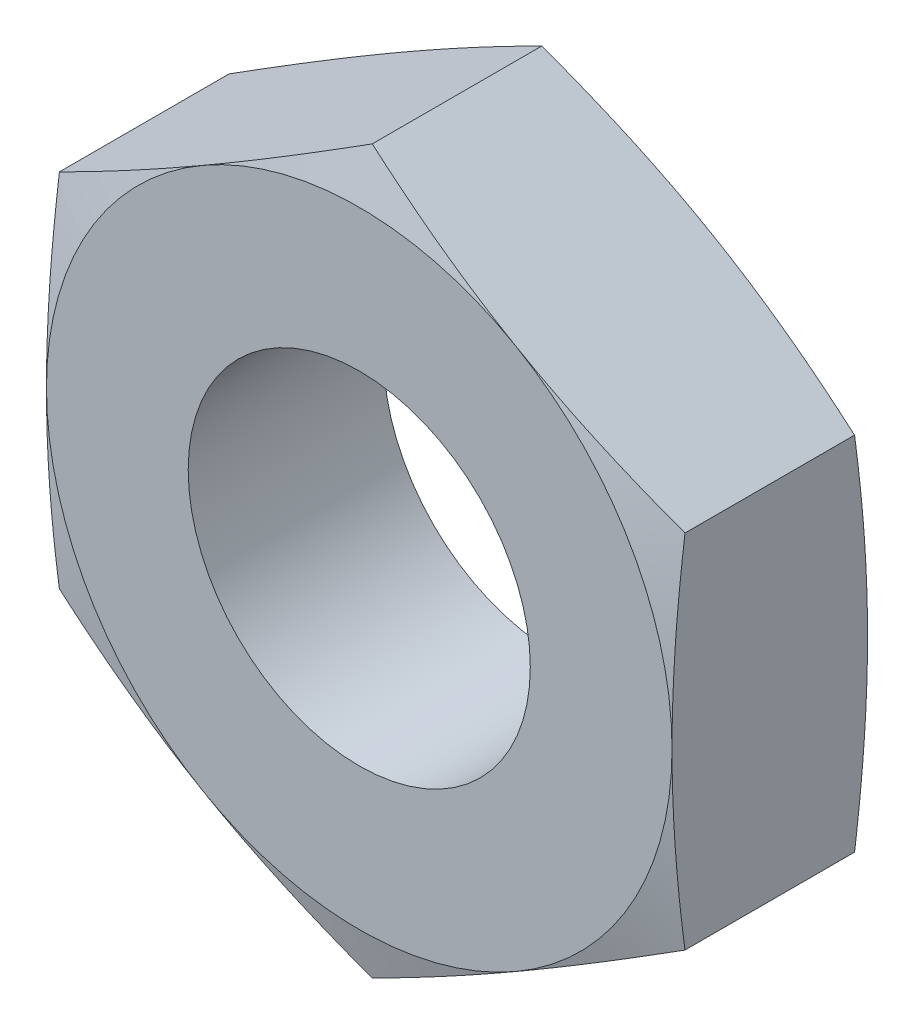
ISO-10303-21;
HEADER;
FILE_DESCRIPTION(('STEP AP214'),'2;1');
FILE_NAME('part.step','',(''),(''),'','','');
FILE_SCHEMA(('AUTOMOTIVE_DESIGN { 1 0 10303 214 1 1 1 1 }'));
ENDSEC;
DATA;
#1=APPLICATION_CONTEXT('core data for automotive mechanical design processes');
#2=APPLICATION_PROTOCOL_DEFINITION('international standard','automotive_design',2000,#1);
#3=PRODUCT_CONTEXT('',#1,'mechanical');
#4=PRODUCT('Part','Part','',(#3));
#5=PRODUCT_RELATED_PRODUCT_CATEGORY('part','',(#4));
#6=PRODUCT_DEFINITION_FORMATION('','',#4);
#7=PRODUCT_DEFINITION_CONTEXT('part definition',#1,'design');
#8=PRODUCT_DEFINITION('design','',#6,#7);
#9=PRODUCT_DEFINITION_SHAPE('','',#8);
#10=(LENGTH_UNIT() NAMED_UNIT(*) SI_UNIT(.MILLI.,.METRE.));
#11=(NAMED_UNIT(*) PLANE_ANGLE_UNIT() SI_UNIT($,.RADIAN.));
#12=(NAMED_UNIT(*) SI_UNIT($,.STERADIAN.) SOLID_ANGLE_UNIT());
#13=UNCERTAINTY_MEASURE_WITH_UNIT(LENGTH_MEASURE(1.E-05),#10,'distance_accuracy_value','');
#14=(GEOMETRIC_REPRESENTATION_CONTEXT(3) GLOBAL_UNCERTAINTY_ASSIGNED_CONTEXT((#13)) GLOBAL_UNIT_ASSIGNED_CONTEXT((#10,
#11,#12)) REPRESENTATION_CONTEXT('',''));
#15=CARTESIAN_POINT('',(0.,0.,0.));
#16=DIRECTION('',(0.,0.,1.));
#17=DIRECTION('',(1.,0.,0.));
#18=AXIS2_PLACEMENT_3D('',#15,#16,#17);
#19=CARTESIAN_POINT('',(0.,9.23760430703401,5.));
#20=DIRECTION('',(0.5,-0.866025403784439,0.));
#21=DIRECTION('',(0.866025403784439,0.5,0.));
#22=AXIS2_PLACEMENT_3D('',#19,#20,#21);
#23=PLANE('',#22);
#24=CARTESIAN_POINT('',(-8.0002,4.61868668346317,0.331646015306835));
#25=CARTESIAN_POINT('',(-7.66796351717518,4.81050350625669,0.280227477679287));
#26=CARTESIAN_POINT('',(-7.33512465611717,5.0026681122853,0.233547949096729));
#27=CARTESIAN_POINT('',(-6.66827150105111,5.38767596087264,0.151536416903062));
#28=CARTESIAN_POINT('',(-6.33425678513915,5.58051944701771,0.116209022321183));
#29=CARTESIAN_POINT('',(-5.66707702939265,5.96571585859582,0.0589641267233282));
#30=CARTESIAN_POINT('',(-5.33391650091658,6.15806617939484,0.036978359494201));
#31=CARTESIAN_POINT('',(-4.66717058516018,6.54301211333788,0.00749769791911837));
#32=CARTESIAN_POINT('',(-4.33358529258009,6.7356076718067,0.));
#33=CARTESIAN_POINT('',(-3.66641470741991,7.12079878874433,0.));
#34=CARTESIAN_POINT('',(-3.33282941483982,7.31339434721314,0.00749769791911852));
#35=CARTESIAN_POINT('',(-2.66608349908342,7.69834028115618,0.0369783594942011));
#36=CARTESIAN_POINT('',(-2.33292297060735,7.8906906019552,0.0589641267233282));
#37=CARTESIAN_POINT('',(-1.66574321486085,8.27588701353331,0.116209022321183));
#38=CARTESIAN_POINT('',(-1.33172849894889,8.46873049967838,0.151536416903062));
#39=CARTESIAN_POINT('',(-0.664875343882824,8.85373834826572,0.23354794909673));
#40=CARTESIAN_POINT('',(-0.332036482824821,9.04590295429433,0.280227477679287));
#41=CARTESIAN_POINT('',(0.000200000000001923,9.23771977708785,0.331646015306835));
#42=B_SPLINE_CURVE_WITH_KNOTS('',3,(#24,#25,#26,#27,#28,#29,#30,#31,#32,#33,#34,#35,#36,#37,#38,
#39,#40,#41),.UNSPECIFIED.,.F.,.F.,(4,2,2,2,2,2,2,2,4),(0.,1.1612532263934,2.322977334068,
3.47870589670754,4.63421079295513,5.78971568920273,6.94544425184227,8.10716835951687,
9.26842158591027),.UNSPECIFIED.);
#43=CARTESIAN_POINT('',(-8.,4.61880215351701,0.331615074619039));
#44=VERTEX_POINT('',#43);
#45=CARTESIAN_POINT('',(-4.,6.92820323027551,0.));
#46=VERTEX_POINT('',#45);
#47=EDGE_CURVE('E126',#44,#46,#42,.T.);
#48=ORIENTED_EDGE('',*,*,#47,.F.);
#49=DIRECTION('',(0.,0.,-1.));
#50=VECTOR('',#49,1.);
#51=CARTESIAN_POINT('',(-8.,4.61880215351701,5.));
#52=LINE('',#51,#50);
#53=CARTESIAN_POINT('',(-8.,4.61880215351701,4.66838492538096));
#54=VERTEX_POINT('',#53);
#55=EDGE_CURVE('E213',#54,#44,#52,.T.);
#56=ORIENTED_EDGE('',*,*,#55,.F.);
#57=CARTESIAN_POINT('',(0.000200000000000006,9.23771977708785,4.66835398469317));
#58=CARTESIAN_POINT('',(-0.332036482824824,9.04590295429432,4.71977252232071));
#59=CARTESIAN_POINT('',(-0.664875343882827,8.85373834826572,4.76645205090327));
#60=CARTESIAN_POINT('',(-1.33172849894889,8.46873049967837,4.84846358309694));
#61=CARTESIAN_POINT('',(-1.66574321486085,8.27588701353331,4.88379097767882));
#62=CARTESIAN_POINT('',(-2.33292297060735,7.8906906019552,4.94103587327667));
#63=CARTESIAN_POINT('',(-2.66608349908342,7.69834028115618,4.9630216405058));
#64=CARTESIAN_POINT('',(-3.33282941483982,7.31339434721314,4.99250230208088));
#65=CARTESIAN_POINT('',(-3.66641470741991,7.12079878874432,5.));
#66=CARTESIAN_POINT('',(-4.33358529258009,6.73560767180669,5.));
#67=CARTESIAN_POINT('',(-4.66717058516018,6.54301211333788,4.99250230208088));
#68=CARTESIAN_POINT('',(-5.33391650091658,6.15806617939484,4.9630216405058));
#69=CARTESIAN_POINT('',(-5.66707702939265,5.96571585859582,4.94103587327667));
#70=CARTESIAN_POINT('',(-6.33425678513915,5.58051944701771,4.88379097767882));
#71=CARTESIAN_POINT('',(-6.66827150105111,5.38767596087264,4.84846358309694));
#72=CARTESIAN_POINT('',(-7.33512465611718,5.0026681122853,4.76645205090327));
#73=CARTESIAN_POINT('',(-7.66796351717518,4.81050350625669,4.71977252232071));
#74=CARTESIAN_POINT('',(-8.0002,4.61868668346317,4.66835398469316));
#75=B_SPLINE_CURVE_WITH_KNOTS('',3,(#57,#58,#59,#60,#61,#62,#63,#64,#65,#66,#67,#68,#69,#70,#71,
#72,#73,#74),.UNSPECIFIED.,.F.,.F.,(4,2,2,2,2,2,2,2,4),(0.,1.1612532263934,2.32297733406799,
3.47870589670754,4.63421079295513,5.78971568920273,6.94544425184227,8.10716835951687,
9.26842158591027),.UNSPECIFIED.);
#76=CARTESIAN_POINT('',(-4.,6.92820323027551,5.));
#77=VERTEX_POINT('',#76);
#78=EDGE_CURVE('E235',#77,#54,#75,.T.);
#79=ORIENTED_EDGE('',*,*,#78,.F.);
#80=CARTESIAN_POINT('',(0.,9.23760430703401,4.66838492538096));
#81=VERTEX_POINT('',#80);
#82=EDGE_CURVE('E232',#81,#77,#75,.T.);
#83=ORIENTED_EDGE('',*,*,#82,.F.);
#84=DIRECTION('',(0.,0.,-1.));
#85=VECTOR('',#84,1.);
#86=CARTESIAN_POINT('',(0.,9.23760430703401,5.));
#87=LINE('',#86,#85);
#88=CARTESIAN_POINT('',(0.,9.23760430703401,0.331615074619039));
#89=VERTEX_POINT('',#88);
#90=EDGE_CURVE('E152',#81,#89,#87,.T.);
#91=ORIENTED_EDGE('',*,*,#90,.T.);
#92=EDGE_CURVE('E135',#46,#89,#42,.T.);
#93=ORIENTED_EDGE('',*,*,#92,.F.);
#94=EDGE_LOOP('',(#48,#56,#79,#83,#91,#93));
#95=FACE_BOUND('',#94,.T.);
#96=ADVANCED_FACE('F39',(#95),#23,.F.);
#97=CARTESIAN_POINT('',(-8.,4.61880215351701,5.));
#98=DIRECTION('',(1.,0.,0.));
#99=DIRECTION('',(0.,0.,-1.));
#100=AXIS2_PLACEMENT_3D('',#97,#98,#99);
#101=PLANE('',#100);
#102=CARTESIAN_POINT('',(-8.,-12.3682525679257,1.80330508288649));
#103=CARTESIAN_POINT('',(-8.,-12.0034230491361,1.72124484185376));
#104=CARTESIAN_POINT('',(-8.,-11.6383693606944,1.64016378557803));
#105=CARTESIAN_POINT('',(-8.,-10.9077031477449,1.48048915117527));
#106=CARTESIAN_POINT('',(-8.,-10.5420906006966,1.40189567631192));
#107=CARTESIAN_POINT('',(-8.,-9.80989736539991,1.24766289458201));
#108=CARTESIAN_POINT('',(-8.,-9.44331610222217,1.1720263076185));
#109=CARTESIAN_POINT('',(-8.,-8.70940097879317,1.02449899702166));
#110=CARTESIAN_POINT('',(-8.,-8.34206712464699,0.95260824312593));
#111=CARTESIAN_POINT('',(-8.,-7.60973985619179,0.814078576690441));
#112=CARTESIAN_POINT('',(-8.,-7.24475414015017,0.747399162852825));
#113=CARTESIAN_POINT('',(-8.,-6.51379588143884,0.619698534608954));
#114=CARTESIAN_POINT('',(-8.,-6.14782335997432,0.558677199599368));
#115=CARTESIAN_POINT('',(-8.,-5.41479624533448,0.443633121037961));
#116=CARTESIAN_POINT('',(-8.,-5.04774172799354,0.389609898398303));
#117=CARTESIAN_POINT('',(-8.,-4.31246065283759,0.290126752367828));
#118=CARTESIAN_POINT('',(-8.,-3.94423409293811,0.244666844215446));
#119=CARTESIAN_POINT('',(-8.,-3.20236026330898,0.163559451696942));
#120=CARTESIAN_POINT('',(-8.,-2.82869967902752,0.128031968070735));
#121=CARTESIAN_POINT('',(-8.,-2.08040761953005,0.0692237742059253));
#122=CARTESIAN_POINT('',(-8.,-1.70577616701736,0.0459427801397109));
#123=CARTESIAN_POINT('',(-8.,-0.95610256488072,0.0129828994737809));
#124=CARTESIAN_POINT('',(-8.,-0.581060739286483,0.00329679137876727));
#125=CARTESIAN_POINT('',(-8.,0.169122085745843,-0.00187611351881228));
#126=CARTESIAN_POINT('',(-8.,0.544263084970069,0.00263705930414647));
#127=CARTESIAN_POINT('',(-8.,1.29576421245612,0.025619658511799));
#128=CARTESIAN_POINT('',(-8.,1.67212242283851,0.0441505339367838));
#129=CARTESIAN_POINT('',(-8.,2.42397398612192,0.0941092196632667));
#130=CARTESIAN_POINT('',(-8.,2.79946731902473,0.125537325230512));
#131=CARTESIAN_POINT('',(-8.,3.54959828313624,0.199666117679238));
#132=CARTESIAN_POINT('',(-8.,3.9242350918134,0.242374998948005));
#133=CARTESIAN_POINT('',(-8.,4.67229383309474,0.337241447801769));
#134=CARTESIAN_POINT('',(-8.,5.04571576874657,0.389398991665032));
#135=CARTESIAN_POINT('',(-8.,5.85012986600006,0.510269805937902));
#136=CARTESIAN_POINT('',(-8.,6.28092305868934,0.580296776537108));
#137=CARTESIAN_POINT('',(-8.,7.14112622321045,0.728430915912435));
#138=CARTESIAN_POINT('',(-8.,7.57053612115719,0.806538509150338));
#139=CARTESIAN_POINT('',(-8.,8.42824225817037,0.969041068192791));
#140=CARTESIAN_POINT('',(-8.,8.85653826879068,1.05343723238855));
#141=CARTESIAN_POINT('',(-8.,9.71212605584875,1.22711208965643));
#142=CARTESIAN_POINT('',(-8.,10.1394178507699,1.31639069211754));
#143=CARTESIAN_POINT('',(-8.,10.9933774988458,1.49882001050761));
#144=CARTESIAN_POINT('',(-8.,11.4200449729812,1.59197249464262));
#145=CARTESIAN_POINT('',(-8.,12.2727071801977,1.78131291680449));
#146=CARTESIAN_POINT('',(-8.,12.6987019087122,1.87750087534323));
#147=CARTESIAN_POINT('',(-8.,13.5501434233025,2.07230679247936));
#148=CARTESIAN_POINT('',(-8.,13.9755901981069,2.17092480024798));
#149=CARTESIAN_POINT('',(-8.,14.8260239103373,2.37012469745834));
#150=CARTESIAN_POINT('',(-8.,15.2510108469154,2.4707065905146));
#151=CARTESIAN_POINT('',(-8.,16.0945743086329,2.67203636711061));
#152=CARTESIAN_POINT('',(-8.,16.513156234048,2.77276164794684));
#153=CARTESIAN_POINT('',(-8.,17.3500012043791,2.97550309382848));
#154=CARTESIAN_POINT('',(-8.,17.7682642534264,3.07751924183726));
#155=CARTESIAN_POINT('',(-8.,19.0226911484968,3.38518557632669));
#156=CARTESIAN_POINT('',(-8.,19.8584600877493,3.59244582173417));
#157=CARTESIAN_POINT('',(-8.,21.5277391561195,4.00963687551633));
#158=CARTESIAN_POINT('',(-8.,22.3612506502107,4.21956223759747));
#159=CARTESIAN_POINT('',(-8.,24.027654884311,4.64169681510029));
#160=CARTESIAN_POINT('',(-8.,24.860547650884,4.85390592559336));
#161=CARTESIAN_POINT('',(-8.,25.6932399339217,5.06689173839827));
#162=B_SPLINE_CURVE_WITH_KNOTS('',3,(#102,#103,#104,#105,#106,#107,#108,#109,#110,#111,#112,
#113,#114,#115,#116,#117,#118,#119,#120,#121,#122,#123,#124,#125,#126,#127,#128,#129,#130,#131,
#132,#133,#134,#135,#136,#137,#138,#139,#140,#141,#142,#143,#144,#145,#146,#147,#148,#149,#150,
#151,#152,#153,#154,#155,#156,#157,#158,#159,#160,#161),.UNSPECIFIED.,.F.,.F.,(4,2,2,2,2,2,2,2,
2,2,2,2,2,2,2,2,2,2,2,2,2,2,2,2,2,2,2,2,2,4),(0.,1.12183777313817,2.24372205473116,
3.36661512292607,4.48949911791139,5.60254330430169,6.71556376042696,7.82850797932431,
8.94145417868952,10.0673166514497,11.1931530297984,12.3183911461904,13.4436268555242,
14.5738240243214,15.7040470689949,16.8350933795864,17.9661368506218,19.2753776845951,
20.5846873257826,21.8942471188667,23.2037826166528,24.5139225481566,25.8240713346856,
27.1342466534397,28.4444243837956,29.7360130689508,31.0275847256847,33.6108287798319,
36.1894473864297,38.767948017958),.UNSPECIFIED.);
#163=CARTESIAN_POINT('',(-8.,-4.61880215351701,0.331615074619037));
#164=VERTEX_POINT('',#163);
#165=CARTESIAN_POINT('',(-8.,0.,0.));
#166=VERTEX_POINT('',#165);
#167=EDGE_CURVE('E262',#164,#166,#162,.T.);
#168=ORIENTED_EDGE('',*,*,#167,.F.);
#169=DIRECTION('',(0.,0.,-1.));
#170=VECTOR('',#169,1.);
#171=CARTESIAN_POINT('',(-8.,-4.61880215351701,5.));
#172=LINE('',#171,#170);
#173=CARTESIAN_POINT('',(-8.,-4.61880215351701,4.66838492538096));
#174=VERTEX_POINT('',#173);
#175=EDGE_CURVE('E215',#174,#164,#172,.T.);
#176=ORIENTED_EDGE('',*,*,#175,.F.);
#177=CARTESIAN_POINT('',(-8.,-12.3682525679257,3.19669491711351));
#178=CARTESIAN_POINT('',(-8.,-12.0034230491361,3.27875515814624));
#179=CARTESIAN_POINT('',(-8.,-11.6383693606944,3.35983621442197));
#180=CARTESIAN_POINT('',(-8.,-10.9077031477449,3.51951084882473));
#181=CARTESIAN_POINT('',(-8.,-10.5420906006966,3.59810432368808));
#182=CARTESIAN_POINT('',(-8.,-9.80989736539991,3.75233710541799));
#183=CARTESIAN_POINT('',(-8.,-9.44331610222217,3.8279736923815));
#184=CARTESIAN_POINT('',(-8.,-8.70940097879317,3.97550100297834));
#185=CARTESIAN_POINT('',(-8.,-8.34206712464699,4.04739175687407));
#186=CARTESIAN_POINT('',(-8.,-7.60973985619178,4.18592142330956));
#187=CARTESIAN_POINT('',(-8.,-7.24475414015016,4.25260083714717));
#188=CARTESIAN_POINT('',(-8.,-6.51379588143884,4.38030146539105));
#189=CARTESIAN_POINT('',(-8.,-6.14782335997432,4.44132280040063));
#190=CARTESIAN_POINT('',(-8.,-5.41479624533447,4.55636687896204));
#191=CARTESIAN_POINT('',(-8.,-5.04774172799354,4.6103901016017));
#192=CARTESIAN_POINT('',(-8.,-4.31246065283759,4.70987324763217));
#193=CARTESIAN_POINT('',(-8.,-3.94423409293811,4.75533315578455));
#194=CARTESIAN_POINT('',(-8.,-3.20236026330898,4.83644054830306));
#195=CARTESIAN_POINT('',(-8.,-2.82869967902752,4.87196803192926));
#196=CARTESIAN_POINT('',(-8.,-2.08040761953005,4.93077622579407));
#197=CARTESIAN_POINT('',(-8.,-1.70577616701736,4.95405721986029));
#198=CARTESIAN_POINT('',(-8.,-0.95610256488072,4.98701710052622));
#199=CARTESIAN_POINT('',(-8.,-0.581060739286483,4.99670320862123));
#200=CARTESIAN_POINT('',(-8.,0.169122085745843,5.00187611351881));
#201=CARTESIAN_POINT('',(-8.,0.544263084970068,4.99736294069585));
#202=CARTESIAN_POINT('',(-8.,1.29576421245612,4.9743803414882));
#203=CARTESIAN_POINT('',(-8.,1.67212242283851,4.95584946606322));
#204=CARTESIAN_POINT('',(-8.,2.42397398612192,4.90589078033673));
#205=CARTESIAN_POINT('',(-8.,2.79946731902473,4.87446267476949));
#206=CARTESIAN_POINT('',(-8.,3.54959828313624,4.80033388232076));
#207=CARTESIAN_POINT('',(-8.,3.9242350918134,4.757625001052));
#208=CARTESIAN_POINT('',(-8.,4.67229383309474,4.66275855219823));
#209=CARTESIAN_POINT('',(-8.,5.04571576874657,4.61060100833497));
#210=CARTESIAN_POINT('',(-8.,5.85012986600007,4.4897301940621));
#211=CARTESIAN_POINT('',(-8.,6.28092305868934,4.41970322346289));
#212=CARTESIAN_POINT('',(-8.,7.14112622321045,4.27156908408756));
#213=CARTESIAN_POINT('',(-8.,7.57053612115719,4.19346149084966));
#214=CARTESIAN_POINT('',(-8.,8.42824225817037,4.03095893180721));
#215=CARTESIAN_POINT('',(-8.,8.85653826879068,3.94656276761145));
#216=CARTESIAN_POINT('',(-8.,9.71212605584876,3.77288791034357));
#217=CARTESIAN_POINT('',(-8.,10.1394178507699,3.68360930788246));
#218=CARTESIAN_POINT('',(-8.,10.9933774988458,3.50117998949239));
#219=CARTESIAN_POINT('',(-8.,11.4200449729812,3.40802750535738));
#220=CARTESIAN_POINT('',(-8.,12.2727071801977,3.21868708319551));
#221=CARTESIAN_POINT('',(-8.,12.6987019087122,3.12249912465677));
#222=CARTESIAN_POINT('',(-8.,13.5501434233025,2.92769320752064));
#223=CARTESIAN_POINT('',(-8.,13.9755901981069,2.82907519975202));
#224=CARTESIAN_POINT('',(-8.,14.8260239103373,2.62987530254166));
#225=CARTESIAN_POINT('',(-8.,15.2510108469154,2.5292934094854));
#226=CARTESIAN_POINT('',(-8.,16.0945743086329,2.32796363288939));
#227=CARTESIAN_POINT('',(-8.,16.513156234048,2.22723835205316));
#228=CARTESIAN_POINT('',(-8.,17.3500012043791,2.02449690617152));
#229=CARTESIAN_POINT('',(-8.,17.7682642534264,1.92248075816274));
#230=CARTESIAN_POINT('',(-8.,19.0226911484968,1.61481442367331));
#231=CARTESIAN_POINT('',(-8.,19.8584600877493,1.40755417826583));
#232=CARTESIAN_POINT('',(-8.,21.5277391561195,0.990363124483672));
#233=CARTESIAN_POINT('',(-8.,22.3612506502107,0.780437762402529));
#234=CARTESIAN_POINT('',(-8.,24.027654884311,0.358303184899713));
#235=CARTESIAN_POINT('',(-8.,24.860547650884,0.146094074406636));
#236=CARTESIAN_POINT('',(-8.,25.6932399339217,-0.0668917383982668));
#237=B_SPLINE_CURVE_WITH_KNOTS('',3,(#177,#178,#179,#180,#181,#182,#183,#184,#185,#186,#187,
#188,#189,#190,#191,#192,#193,#194,#195,#196,#197,#198,#199,#200,#201,#202,#203,#204,#205,#206,
#207,#208,#209,#210,#211,#212,#213,#214,#215,#216,#217,#218,#219,#220,#221,#222,#223,#224,#225,
#226,#227,#228,#229,#230,#231,#232,#233,#234,#235,#236),.UNSPECIFIED.,.F.,.F.,(4,2,2,2,2,2,2,2,
2,2,2,2,2,2,2,2,2,2,2,2,2,2,2,2,2,2,2,2,2,4),(0.,1.12183777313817,2.24372205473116,
3.36661512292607,4.4894991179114,5.6025433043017,6.71556376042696,7.82850797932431,
8.94145417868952,10.0673166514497,11.1931530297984,12.3183911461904,13.4436268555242,
14.5738240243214,15.7040470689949,16.8350933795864,17.9661368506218,19.2753776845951,
20.5846873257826,21.8942471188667,23.2037826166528,24.5139225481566,25.8240713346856,
27.1342466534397,28.4444243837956,29.7360130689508,31.0275847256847,33.6108287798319,
36.1894473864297,38.767948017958),.UNSPECIFIED.);
#238=CARTESIAN_POINT('',(-8.,0.,5.));
#239=VERTEX_POINT('',#238);
#240=EDGE_CURVE('E241',#239,#174,#237,.F.);
#241=ORIENTED_EDGE('',*,*,#240,.F.);
#242=EDGE_CURVE('E240',#54,#239,#237,.F.);
#243=ORIENTED_EDGE('',*,*,#242,.F.);
#244=ORIENTED_EDGE('',*,*,#55,.T.);
#245=EDGE_CURVE('E129',#166,#44,#162,.T.);
#246=ORIENTED_EDGE('',*,*,#245,.F.);
#247=EDGE_LOOP('',(#168,#176,#241,#243,#244,#246));
#248=FACE_BOUND('',#247,.T.);
#249=ADVANCED_FACE('F252',(#248),#101,.F.);
#250=CARTESIAN_POINT('',(0.,-9.23760430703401,5.));
#251=DIRECTION('',(0.5,0.866025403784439,0.));
#252=DIRECTION('',(-0.866025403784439,0.5,0.));
#253=AXIS2_PLACEMENT_3D('',#250,#251,#252);
#254=PLANE('',#253);
#255=CARTESIAN_POINT('',(0.000200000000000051,-9.23771977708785,0.331646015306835));
#256=CARTESIAN_POINT('',(-0.332036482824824,-9.04590295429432,0.280227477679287));
#257=CARTESIAN_POINT('',(-0.664875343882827,-8.85373834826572,0.233547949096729));
#258=CARTESIAN_POINT('',(-1.33172849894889,-8.46873049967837,0.151536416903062));
#259=CARTESIAN_POINT('',(-1.66574321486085,-8.27588701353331,0.116209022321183));
#260=CARTESIAN_POINT('',(-2.33292297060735,-7.8906906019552,0.058964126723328));
#261=CARTESIAN_POINT('',(-2.66608349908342,-7.69834028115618,0.0369783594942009));
#262=CARTESIAN_POINT('',(-3.33282941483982,-7.31339434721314,0.00749769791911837));
#263=CARTESIAN_POINT('',(-3.66641470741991,-7.12079878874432,0.));
#264=CARTESIAN_POINT('',(-4.33358529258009,-6.73560767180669,0.));
#265=CARTESIAN_POINT('',(-4.66717058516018,-6.54301211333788,0.00749769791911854));
#266=CARTESIAN_POINT('',(-5.33391650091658,-6.15806617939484,0.0369783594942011));
#267=CARTESIAN_POINT('',(-5.66707702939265,-5.96571585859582,0.0589641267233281));
#268=CARTESIAN_POINT('',(-6.33425678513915,-5.58051944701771,0.116209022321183));
#269=CARTESIAN_POINT('',(-6.66827150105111,-5.38767596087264,0.151536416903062));
#270=CARTESIAN_POINT('',(-7.33512465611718,-5.0026681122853,0.23354794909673));
#271=CARTESIAN_POINT('',(-7.66796351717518,-4.81050350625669,0.280227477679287));
#272=CARTESIAN_POINT('',(-8.0002,-4.61868668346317,0.331646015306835));
#273=B_SPLINE_CURVE_WITH_KNOTS('',3,(#255,#256,#257,#258,#259,#260,#261,#262,#263,#264,#265,
#266,#267,#268,#269,#270,#271,#272),.UNSPECIFIED.,.F.,.F.,(4,2,2,2,2,2,2,2,4),(0.,
1.1612532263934,2.322977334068,3.47870589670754,4.63421079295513,5.78971568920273,
6.94544425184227,8.10716835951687,9.26842158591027),.UNSPECIFIED.);
#274=CARTESIAN_POINT('',(0.,-9.23760430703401,0.331615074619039));
#275=VERTEX_POINT('',#274);
#276=CARTESIAN_POINT('',(-4.,-6.92820323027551,0.));
#277=VERTEX_POINT('',#276);
#278=EDGE_CURVE('E270',#275,#277,#273,.T.);
#279=ORIENTED_EDGE('',*,*,#278,.F.);
#280=DIRECTION('',(0.,0.,-1.));
#281=VECTOR('',#280,1.);
#282=CARTESIAN_POINT('',(0.,-9.23760430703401,5.));
#283=LINE('',#282,#281);
#284=CARTESIAN_POINT('',(0.,-9.23760430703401,4.66838492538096));
#285=VERTEX_POINT('',#284);
#286=EDGE_CURVE('E218',#285,#275,#283,.T.);
#287=ORIENTED_EDGE('',*,*,#286,.F.);
#288=CARTESIAN_POINT('',(-8.0002,-4.61868668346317,4.66835398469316));
#289=CARTESIAN_POINT('',(-7.66796351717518,-4.81050350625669,4.71977252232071));
#290=CARTESIAN_POINT('',(-7.33512465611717,-5.0026681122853,4.76645205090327));
#291=CARTESIAN_POINT('',(-6.66827150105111,-5.38767596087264,4.84846358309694));
#292=CARTESIAN_POINT('',(-6.33425678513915,-5.58051944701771,4.88379097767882));
#293=CARTESIAN_POINT('',(-5.66707702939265,-5.96571585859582,4.94103587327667));
#294=CARTESIAN_POINT('',(-5.33391650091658,-6.15806617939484,4.9630216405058));
#295=CARTESIAN_POINT('',(-4.66717058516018,-6.54301211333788,4.99250230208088));
#296=CARTESIAN_POINT('',(-4.33358529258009,-6.7356076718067,5.));
#297=CARTESIAN_POINT('',(-3.66641470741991,-7.12079878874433,5.));
#298=CARTESIAN_POINT('',(-3.33282941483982,-7.31339434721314,4.99250230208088));
#299=CARTESIAN_POINT('',(-2.66608349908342,-7.69834028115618,4.9630216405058));
#300=CARTESIAN_POINT('',(-2.33292297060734,-7.8906906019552,4.94103587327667));
#301=CARTESIAN_POINT('',(-1.66574321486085,-8.27588701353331,4.88379097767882));
#302=CARTESIAN_POINT('',(-1.33172849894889,-8.46873049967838,4.84846358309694));
#303=CARTESIAN_POINT('',(-0.664875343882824,-8.85373834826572,4.76645205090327));
#304=CARTESIAN_POINT('',(-0.332036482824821,-9.04590295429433,4.71977252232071));
#305=CARTESIAN_POINT('',(0.000200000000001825,-9.23771977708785,4.66835398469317));
#306=B_SPLINE_CURVE_WITH_KNOTS('',3,(#288,#289,#290,#291,#292,#293,#294,#295,#296,#297,#298,
#299,#300,#301,#302,#303,#304,#305),.UNSPECIFIED.,.F.,.F.,(4,2,2,2,2,2,2,2,4),(0.,
1.1612532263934,2.322977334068,3.47870589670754,4.63421079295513,5.78971568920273,
6.94544425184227,8.10716835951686,9.26842158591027),.UNSPECIFIED.);
#307=CARTESIAN_POINT('',(-4.,-6.92820323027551,5.));
#308=VERTEX_POINT('',#307);
#309=EDGE_CURVE('E247',#308,#285,#306,.T.);
#310=ORIENTED_EDGE('',*,*,#309,.F.);
#311=EDGE_CURVE('E246',#174,#308,#306,.T.);
#312=ORIENTED_EDGE('',*,*,#311,.F.);
#313=ORIENTED_EDGE('',*,*,#175,.T.);
#314=EDGE_CURVE('E185',#277,#164,#273,.T.);
#315=ORIENTED_EDGE('',*,*,#314,.F.);
#316=EDGE_LOOP('',(#279,#287,#310,#312,#313,#315));
#317=FACE_BOUND('',#316,.T.);
#318=ADVANCED_FACE('F255',(#317),#254,.F.);
#319=CARTESIAN_POINT('',(0.,-9.23760430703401,5.));
#320=DIRECTION('',(-0.5,0.866025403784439,0.));
#321=DIRECTION('',(-0.866025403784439,-0.5,0.));
#322=AXIS2_PLACEMENT_3D('',#319,#320,#321);
#323=PLANE('',#322);
#324=CARTESIAN_POINT('',(8.0002,-4.61868668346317,0.331646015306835));
#325=CARTESIAN_POINT('',(7.66796351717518,-4.81050350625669,0.280227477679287));
#326=CARTESIAN_POINT('',(7.33512465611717,-5.0026681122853,0.233547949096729));
#327=CARTESIAN_POINT('',(6.66827150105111,-5.38767596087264,0.151536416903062));
#328=CARTESIAN_POINT('',(6.33425678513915,-5.58051944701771,0.116209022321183));
#329=CARTESIAN_POINT('',(5.66707702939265,-5.96571585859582,0.0589641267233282));
#330=CARTESIAN_POINT('',(5.33391650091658,-6.15806617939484,0.036978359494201));
#331=CARTESIAN_POINT('',(4.66717058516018,-6.54301211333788,0.00749769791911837));
#332=CARTESIAN_POINT('',(4.33358529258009,-6.7356076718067,0.));
#333=CARTESIAN_POINT('',(3.66641470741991,-7.12079878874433,0.));
#334=CARTESIAN_POINT('',(3.33282941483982,-7.31339434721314,0.00749769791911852));
#335=CARTESIAN_POINT('',(2.66608349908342,-7.69834028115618,0.0369783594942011));
#336=CARTESIAN_POINT('',(2.33292297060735,-7.8906906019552,0.0589641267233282));
#337=CARTESIAN_POINT('',(1.66574321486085,-8.27588701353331,0.116209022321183));
#338=CARTESIAN_POINT('',(1.33172849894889,-8.46873049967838,0.151536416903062));
#339=CARTESIAN_POINT('',(0.664875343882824,-8.85373834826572,0.23354794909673));
#340=CARTESIAN_POINT('',(0.332036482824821,-9.04590295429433,0.280227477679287));
#341=CARTESIAN_POINT('',(-0.000200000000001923,-9.23771977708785,0.331646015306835));
#342=B_SPLINE_CURVE_WITH_KNOTS('',3,(#324,#325,#326,#327,#328,#329,#330,#331,#332,#333,#334,
#335,#336,#337,#338,#339,#340,#341),.UNSPECIFIED.,.F.,.F.,(4,2,2,2,2,2,2,2,4),(0.,
1.1612532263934,2.322977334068,3.47870589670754,4.63421079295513,5.78971568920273,
6.94544425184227,8.10716835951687,9.26842158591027),.UNSPECIFIED.);
#343=CARTESIAN_POINT('',(8.,-4.61880215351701,0.331615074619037));
#344=VERTEX_POINT('',#343);
#345=CARTESIAN_POINT('',(4.,-6.92820323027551,0.));
#346=VERTEX_POINT('',#345);
#347=EDGE_CURVE('E165',#344,#346,#342,.T.);
#348=ORIENTED_EDGE('',*,*,#347,.F.);
#349=DIRECTION('',(0.,0.,-1.));
#350=VECTOR('',#349,1.);
#351=CARTESIAN_POINT('',(8.,-4.61880215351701,5.));
#352=LINE('',#351,#350);
#353=CARTESIAN_POINT('',(8.,-4.61880215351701,4.66838492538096));
#354=VERTEX_POINT('',#353);
#355=EDGE_CURVE('E221',#354,#344,#352,.T.);
#356=ORIENTED_EDGE('',*,*,#355,.F.);
#357=CARTESIAN_POINT('',(-0.000200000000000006,-9.23771977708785,4.66835398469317));
#358=CARTESIAN_POINT('',(0.332036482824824,-9.04590295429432,4.71977252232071));
#359=CARTESIAN_POINT('',(0.664875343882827,-8.85373834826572,4.76645205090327));
#360=CARTESIAN_POINT('',(1.33172849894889,-8.46873049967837,4.84846358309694));
#361=CARTESIAN_POINT('',(1.66574321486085,-8.27588701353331,4.88379097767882));
#362=CARTESIAN_POINT('',(2.33292297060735,-7.8906906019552,4.94103587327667));
#363=CARTESIAN_POINT('',(2.66608349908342,-7.69834028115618,4.9630216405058));
#364=CARTESIAN_POINT('',(3.33282941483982,-7.31339434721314,4.99250230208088));
#365=CARTESIAN_POINT('',(3.66641470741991,-7.12079878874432,5.));
#366=CARTESIAN_POINT('',(4.33358529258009,-6.73560767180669,5.));
#367=CARTESIAN_POINT('',(4.66717058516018,-6.54301211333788,4.99250230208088));
#368=CARTESIAN_POINT('',(5.33391650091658,-6.15806617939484,4.9630216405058));
#369=CARTESIAN_POINT('',(5.66707702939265,-5.96571585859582,4.94103587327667));
#370=CARTESIAN_POINT('',(6.33425678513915,-5.58051944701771,4.88379097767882));
#371=CARTESIAN_POINT('',(6.66827150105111,-5.38767596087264,4.84846358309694));
#372=CARTESIAN_POINT('',(7.33512465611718,-5.0026681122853,4.76645205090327));
#373=CARTESIAN_POINT('',(7.66796351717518,-4.81050350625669,4.71977252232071));
#374=CARTESIAN_POINT('',(8.0002,-4.61868668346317,4.66835398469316));
#375=B_SPLINE_CURVE_WITH_KNOTS('',3,(#357,#358,#359,#360,#361,#362,#363,#364,#365,#366,#367,
#368,#369,#370,#371,#372,#373,#374),.UNSPECIFIED.,.F.,.F.,(4,2,2,2,2,2,2,2,4),(0.,
1.1612532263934,2.32297733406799,3.47870589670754,4.63421079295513,5.78971568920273,
6.94544425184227,8.10716835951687,9.26842158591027),.UNSPECIFIED.);
#376=CARTESIAN_POINT('',(4.,-6.92820323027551,5.));
#377=VERTEX_POINT('',#376);
#378=EDGE_CURVE('E311',#377,#354,#375,.T.);
#379=ORIENTED_EDGE('',*,*,#378,.F.);
#380=EDGE_CURVE('E307',#285,#377,#375,.T.);
#381=ORIENTED_EDGE('',*,*,#380,.F.);
#382=ORIENTED_EDGE('',*,*,#286,.T.);
#383=EDGE_CURVE('E263',#346,#275,#342,.T.);
#384=ORIENTED_EDGE('',*,*,#383,.F.);
#385=EDGE_LOOP('',(#348,#356,#379,#381,#382,#384));
#386=FACE_BOUND('',#385,.T.);
#387=ADVANCED_FACE('F319',(#386),#323,.F.);
#388=CARTESIAN_POINT('',(8.,4.61880215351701,5.));
#389=DIRECTION('',(-1.,0.,0.));
#390=DIRECTION('',(0.,0.,1.));
#391=AXIS2_PLACEMENT_3D('',#388,#389,#390);
#392=PLANE('',#391);
#393=CARTESIAN_POINT('',(8.,-12.3682525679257,1.80330508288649));
#394=CARTESIAN_POINT('',(8.,-12.0034230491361,1.72124484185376));
#395=CARTESIAN_POINT('',(8.,-11.6383693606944,1.64016378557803));
#396=CARTESIAN_POINT('',(8.,-10.9077031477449,1.48048915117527));
#397=CARTESIAN_POINT('',(8.,-10.5420906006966,1.40189567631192));
#398=CARTESIAN_POINT('',(8.,-9.80989736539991,1.24766289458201));
#399=CARTESIAN_POINT('',(8.,-9.44331610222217,1.1720263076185));
#400=CARTESIAN_POINT('',(8.,-8.70940097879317,1.02449899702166));
#401=CARTESIAN_POINT('',(8.,-8.34206712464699,0.95260824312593));
#402=CARTESIAN_POINT('',(8.,-7.60973985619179,0.814078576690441));
#403=CARTESIAN_POINT('',(8.,-7.24475414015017,0.747399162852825));
#404=CARTESIAN_POINT('',(8.,-6.51379588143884,0.619698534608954));
#405=CARTESIAN_POINT('',(8.,-6.14782335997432,0.558677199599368));
#406=CARTESIAN_POINT('',(8.,-5.41479624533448,0.443633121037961));
#407=CARTESIAN_POINT('',(8.,-5.04774172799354,0.389609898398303));
#408=CARTESIAN_POINT('',(8.,-4.31246065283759,0.290126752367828));
#409=CARTESIAN_POINT('',(8.,-3.94423409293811,0.244666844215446));
#410=CARTESIAN_POINT('',(8.,-3.20236026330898,0.163559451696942));
#411=CARTESIAN_POINT('',(8.,-2.82869967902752,0.128031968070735));
#412=CARTESIAN_POINT('',(8.,-2.08040761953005,0.0692237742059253));
#413=CARTESIAN_POINT('',(8.,-1.70577616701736,0.0459427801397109));
#414=CARTESIAN_POINT('',(8.,-0.95610256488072,0.0129828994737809));
#415=CARTESIAN_POINT('',(8.,-0.581060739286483,0.00329679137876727));
#416=CARTESIAN_POINT('',(8.,0.169122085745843,-0.00187611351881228));
#417=CARTESIAN_POINT('',(8.,0.544263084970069,0.00263705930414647));
#418=CARTESIAN_POINT('',(8.,1.29576421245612,0.025619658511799));
#419=CARTESIAN_POINT('',(8.,1.67212242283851,0.0441505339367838));
#420=CARTESIAN_POINT('',(8.,2.42397398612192,0.0941092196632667));
#421=CARTESIAN_POINT('',(8.,2.79946731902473,0.125537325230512));
#422=CARTESIAN_POINT('',(8.,3.54959828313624,0.199666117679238));
#423=CARTESIAN_POINT('',(8.,3.9242350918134,0.242374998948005));
#424=CARTESIAN_POINT('',(8.,4.67229383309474,0.337241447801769));
#425=CARTESIAN_POINT('',(8.,5.04571576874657,0.389398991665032));
#426=CARTESIAN_POINT('',(8.,5.85012986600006,0.510269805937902));
#427=CARTESIAN_POINT('',(8.,6.28092305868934,0.580296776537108));
#428=CARTESIAN_POINT('',(8.,7.14112622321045,0.728430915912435));
#429=CARTESIAN_POINT('',(8.,7.57053612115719,0.806538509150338));
#430=CARTESIAN_POINT('',(8.,8.42824225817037,0.969041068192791));
#431=CARTESIAN_POINT('',(8.,8.85653826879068,1.05343723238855));
#432=CARTESIAN_POINT('',(8.,9.71212605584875,1.22711208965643));
#433=CARTESIAN_POINT('',(8.,10.1394178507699,1.31639069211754));
#434=CARTESIAN_POINT('',(8.,10.9933774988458,1.49882001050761));
#435=CARTESIAN_POINT('',(8.,11.4200449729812,1.59197249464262));
#436=CARTESIAN_POINT('',(8.,12.2727071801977,1.78131291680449));
#437=CARTESIAN_POINT('',(8.,12.6987019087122,1.87750087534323));
#438=CARTESIAN_POINT('',(8.,13.5501434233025,2.07230679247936));
#439=CARTESIAN_POINT('',(8.,13.9755901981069,2.17092480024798));
#440=CARTESIAN_POINT('',(8.,14.8260239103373,2.37012469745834));
#441=CARTESIAN_POINT('',(8.,15.2510108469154,2.4707065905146));
#442=CARTESIAN_POINT('',(8.,16.0945743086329,2.67203636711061));
#443=CARTESIAN_POINT('',(8.,16.513156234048,2.77276164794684));
#444=CARTESIAN_POINT('',(8.,17.3500012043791,2.97550309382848));
#445=CARTESIAN_POINT('',(8.,17.7682642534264,3.07751924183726));
#446=CARTESIAN_POINT('',(8.,19.0226911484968,3.38518557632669));
#447=CARTESIAN_POINT('',(8.,19.8584600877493,3.59244582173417));
#448=CARTESIAN_POINT('',(8.,21.5277391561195,4.00963687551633));
#449=CARTESIAN_POINT('',(8.,22.3612506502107,4.21956223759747));
#450=CARTESIAN_POINT('',(8.,24.027654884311,4.64169681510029));
#451=CARTESIAN_POINT('',(8.,24.860547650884,4.85390592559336));
#452=CARTESIAN_POINT('',(8.,25.6932399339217,5.06689173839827));
#453=B_SPLINE_CURVE_WITH_KNOTS('',3,(#393,#394,#395,#396,#397,#398,#399,#400,#401,#402,#403,
#404,#405,#406,#407,#408,#409,#410,#411,#412,#413,#414,#415,#416,#417,#418,#419,#420,#421,#422,
#423,#424,#425,#426,#427,#428,#429,#430,#431,#432,#433,#434,#435,#436,#437,#438,#439,#440,#441,
#442,#443,#444,#445,#446,#447,#448,#449,#450,#451,#452),.UNSPECIFIED.,.F.,.F.,(4,2,2,2,2,2,2,2,
2,2,2,2,2,2,2,2,2,2,2,2,2,2,2,2,2,2,2,2,2,4),(0.,1.12183777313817,2.24372205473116,
3.36661512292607,4.48949911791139,5.60254330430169,6.71556376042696,7.82850797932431,
8.94145417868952,10.0673166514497,11.1931530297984,12.3183911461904,13.4436268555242,
14.5738240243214,15.7040470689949,16.8350933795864,17.9661368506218,19.2753776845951,
20.5846873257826,21.8942471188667,23.2037826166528,24.5139225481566,25.8240713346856,
27.1342466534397,28.4444243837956,29.7360130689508,31.0275847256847,33.6108287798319,
36.1894473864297,38.767948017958),.UNSPECIFIED.);
#454=CARTESIAN_POINT('',(8.,4.61880215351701,0.331615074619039));
#455=VERTEX_POINT('',#454);
#456=CARTESIAN_POINT('',(8.,0.,0.));
#457=VERTEX_POINT('',#456);
#458=EDGE_CURVE('E153',#455,#457,#453,.F.);
#459=ORIENTED_EDGE('',*,*,#458,.F.);
#460=DIRECTION('',(0.,0.,-1.));
#461=VECTOR('',#460,1.);
#462=CARTESIAN_POINT('',(8.,4.61880215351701,5.));
#463=LINE('',#462,#461);
#464=CARTESIAN_POINT('',(8.,4.61880215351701,4.66838492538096));
#465=VERTEX_POINT('',#464);
#466=EDGE_CURVE('E224',#465,#455,#463,.T.);
#467=ORIENTED_EDGE('',*,*,#466,.F.);
#468=CARTESIAN_POINT('',(8.,-12.3682525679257,3.19669491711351));
#469=CARTESIAN_POINT('',(8.,-12.0034230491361,3.27875515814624));
#470=CARTESIAN_POINT('',(8.,-11.6383693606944,3.35983621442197));
#471=CARTESIAN_POINT('',(8.,-10.9077031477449,3.51951084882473));
#472=CARTESIAN_POINT('',(8.,-10.5420906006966,3.59810432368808));
#473=CARTESIAN_POINT('',(8.,-9.80989736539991,3.75233710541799));
#474=CARTESIAN_POINT('',(8.,-9.44331610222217,3.8279736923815));
#475=CARTESIAN_POINT('',(8.,-8.70940097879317,3.97550100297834));
#476=CARTESIAN_POINT('',(8.,-8.34206712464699,4.04739175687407));
#477=CARTESIAN_POINT('',(8.,-7.60973985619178,4.18592142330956));
#478=CARTESIAN_POINT('',(8.,-7.24475414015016,4.25260083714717));
#479=CARTESIAN_POINT('',(8.,-6.51379588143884,4.38030146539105));
#480=CARTESIAN_POINT('',(8.,-6.14782335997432,4.44132280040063));
#481=CARTESIAN_POINT('',(8.,-5.41479624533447,4.55636687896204));
#482=CARTESIAN_POINT('',(8.,-5.04774172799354,4.6103901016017));
#483=CARTESIAN_POINT('',(8.,-4.31246065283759,4.70987324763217));
#484=CARTESIAN_POINT('',(8.,-3.94423409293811,4.75533315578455));
#485=CARTESIAN_POINT('',(8.,-3.20236026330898,4.83644054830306));
#486=CARTESIAN_POINT('',(8.,-2.82869967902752,4.87196803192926));
#487=CARTESIAN_POINT('',(8.,-2.08040761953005,4.93077622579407));
#488=CARTESIAN_POINT('',(8.,-1.70577616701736,4.95405721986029));
#489=CARTESIAN_POINT('',(8.,-0.95610256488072,4.98701710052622));
#490=CARTESIAN_POINT('',(8.,-0.581060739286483,4.99670320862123));
#491=CARTESIAN_POINT('',(8.,0.169122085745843,5.00187611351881));
#492=CARTESIAN_POINT('',(8.,0.544263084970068,4.99736294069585));
#493=CARTESIAN_POINT('',(8.,1.29576421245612,4.9743803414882));
#494=CARTESIAN_POINT('',(8.,1.67212242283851,4.95584946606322));
#495=CARTESIAN_POINT('',(8.,2.42397398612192,4.90589078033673));
#496=CARTESIAN_POINT('',(8.,2.79946731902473,4.87446267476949));
#497=CARTESIAN_POINT('',(8.,3.54959828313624,4.80033388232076));
#498=CARTESIAN_POINT('',(8.,3.9242350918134,4.757625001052));
#499=CARTESIAN_POINT('',(8.,4.67229383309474,4.66275855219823));
#500=CARTESIAN_POINT('',(8.,5.04571576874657,4.61060100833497));
#501=CARTESIAN_POINT('',(8.,5.85012986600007,4.4897301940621));
#502=CARTESIAN_POINT('',(8.,6.28092305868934,4.41970322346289));
#503=CARTESIAN_POINT('',(8.,7.14112622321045,4.27156908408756));
#504=CARTESIAN_POINT('',(8.,7.57053612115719,4.19346149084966));
#505=CARTESIAN_POINT('',(8.,8.42824225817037,4.03095893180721));
#506=CARTESIAN_POINT('',(8.,8.85653826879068,3.94656276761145));
#507=CARTESIAN_POINT('',(8.,9.71212605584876,3.77288791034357));
#508=CARTESIAN_POINT('',(8.,10.1394178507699,3.68360930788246));
#509=CARTESIAN_POINT('',(8.,10.9933774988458,3.50117998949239));
#510=CARTESIAN_POINT('',(8.,11.4200449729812,3.40802750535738));
#511=CARTESIAN_POINT('',(8.,12.2727071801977,3.21868708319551));
#512=CARTESIAN_POINT('',(8.,12.6987019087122,3.12249912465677));
#513=CARTESIAN_POINT('',(8.,13.5501434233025,2.92769320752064));
#514=CARTESIAN_POINT('',(8.,13.9755901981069,2.82907519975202));
#515=CARTESIAN_POINT('',(8.,14.8260239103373,2.62987530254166));
#516=CARTESIAN_POINT('',(8.,15.2510108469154,2.5292934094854));
#517=CARTESIAN_POINT('',(8.,16.0945743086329,2.32796363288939));
#518=CARTESIAN_POINT('',(8.,16.513156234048,2.22723835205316));
#519=CARTESIAN_POINT('',(8.,17.3500012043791,2.02449690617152));
#520=CARTESIAN_POINT('',(8.,17.7682642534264,1.92248075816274));
#521=CARTESIAN_POINT('',(8.,19.0226911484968,1.61481442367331));
#522=CARTESIAN_POINT('',(8.,19.8584600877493,1.40755417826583));
#523=CARTESIAN_POINT('',(8.,21.5277391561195,0.990363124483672));
#524=CARTESIAN_POINT('',(8.,22.3612506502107,0.780437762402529));
#525=CARTESIAN_POINT('',(8.,24.027654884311,0.358303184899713));
#526=CARTESIAN_POINT('',(8.,24.860547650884,0.146094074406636));
#527=CARTESIAN_POINT('',(8.,25.6932399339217,-0.0668917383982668));
#528=B_SPLINE_CURVE_WITH_KNOTS('',3,(#468,#469,#470,#471,#472,#473,#474,#475,#476,#477,#478,
#479,#480,#481,#482,#483,#484,#485,#486,#487,#488,#489,#490,#491,#492,#493,#494,#495,#496,#497,
#498,#499,#500,#501,#502,#503,#504,#505,#506,#507,#508,#509,#510,#511,#512,#513,#514,#515,#516,
#517,#518,#519,#520,#521,#522,#523,#524,#525,#526,#527),.UNSPECIFIED.,.F.,.F.,(4,2,2,2,2,2,2,2,
2,2,2,2,2,2,2,2,2,2,2,2,2,2,2,2,2,2,2,2,2,4),(0.,1.12183777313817,2.24372205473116,
3.36661512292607,4.4894991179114,5.6025433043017,6.71556376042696,7.82850797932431,
8.94145417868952,10.0673166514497,11.1931530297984,12.3183911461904,13.4436268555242,
14.5738240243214,15.7040470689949,16.8350933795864,17.9661368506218,19.2753776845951,
20.5846873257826,21.8942471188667,23.2037826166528,24.5139225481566,25.8240713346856,
27.1342466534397,28.4444243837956,29.7360130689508,31.0275847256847,33.6108287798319,
36.1894473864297,38.767948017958),.UNSPECIFIED.);
#529=CARTESIAN_POINT('',(8.,0.,5.));
#530=VERTEX_POINT('',#529);
#531=EDGE_CURVE('E283',#530,#465,#528,.T.);
#532=ORIENTED_EDGE('',*,*,#531,.F.);
#533=EDGE_CURVE('E286',#354,#530,#528,.T.);
#534=ORIENTED_EDGE('',*,*,#533,.F.);
#535=ORIENTED_EDGE('',*,*,#355,.T.);
#536=EDGE_CURVE('E134',#457,#344,#453,.F.);
#537=ORIENTED_EDGE('',*,*,#536,.F.);
#538=EDGE_LOOP('',(#459,#467,#532,#534,#535,#537));
#539=FACE_BOUND('',#538,.T.);
#540=ADVANCED_FACE('F202',(#539),#392,.F.);
#541=CARTESIAN_POINT('',(0.,9.23760430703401,5.));
#542=DIRECTION('',(-0.5,-0.866025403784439,0.));
#543=DIRECTION('',(0.866025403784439,-0.5,0.));
#544=AXIS2_PLACEMENT_3D('',#541,#542,#543);
#545=PLANE('',#544);
#546=CARTESIAN_POINT('',(-0.000200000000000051,9.23771977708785,0.331646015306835));
#547=CARTESIAN_POINT('',(0.332036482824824,9.04590295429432,0.280227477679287));
#548=CARTESIAN_POINT('',(0.664875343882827,8.85373834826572,0.233547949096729));
#549=CARTESIAN_POINT('',(1.33172849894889,8.46873049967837,0.151536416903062));
#550=CARTESIAN_POINT('',(1.66574321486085,8.27588701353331,0.116209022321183));
#551=CARTESIAN_POINT('',(2.33292297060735,7.8906906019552,0.058964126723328));
#552=CARTESIAN_POINT('',(2.66608349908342,7.69834028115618,0.0369783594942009));
#553=CARTESIAN_POINT('',(3.33282941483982,7.31339434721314,0.00749769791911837));
#554=CARTESIAN_POINT('',(3.66641470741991,7.12079878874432,0.));
#555=CARTESIAN_POINT('',(4.33358529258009,6.73560767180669,0.));
#556=CARTESIAN_POINT('',(4.66717058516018,6.54301211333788,0.00749769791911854));
#557=CARTESIAN_POINT('',(5.33391650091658,6.15806617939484,0.0369783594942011));
#558=CARTESIAN_POINT('',(5.66707702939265,5.96571585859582,0.0589641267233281));
#559=CARTESIAN_POINT('',(6.33425678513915,5.58051944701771,0.116209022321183));
#560=CARTESIAN_POINT('',(6.66827150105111,5.38767596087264,0.151536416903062));
#561=CARTESIAN_POINT('',(7.33512465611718,5.0026681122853,0.23354794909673));
#562=CARTESIAN_POINT('',(7.66796351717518,4.81050350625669,0.280227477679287));
#563=CARTESIAN_POINT('',(8.0002,4.61868668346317,0.331646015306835));
#564=B_SPLINE_CURVE_WITH_KNOTS('',3,(#546,#547,#548,#549,#550,#551,#552,#553,#554,#555,#556,
#557,#558,#559,#560,#561,#562,#563),.UNSPECIFIED.,.F.,.F.,(4,2,2,2,2,2,2,2,4),(0.,
1.1612532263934,2.322977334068,3.47870589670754,4.63421079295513,5.78971568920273,
6.94544425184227,8.10716835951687,9.26842158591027),.UNSPECIFIED.);
#565=CARTESIAN_POINT('',(4.,6.92820323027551,0.));
#566=VERTEX_POINT('',#565);
#567=EDGE_CURVE('E141',#89,#566,#564,.T.);
#568=ORIENTED_EDGE('',*,*,#567,.F.);
#569=ORIENTED_EDGE('',*,*,#90,.F.);
#570=CARTESIAN_POINT('',(8.0002,4.61868668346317,4.66835398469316));
#571=CARTESIAN_POINT('',(7.66796351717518,4.81050350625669,4.71977252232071));
#572=CARTESIAN_POINT('',(7.33512465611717,5.0026681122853,4.76645205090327));
#573=CARTESIAN_POINT('',(6.66827150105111,5.38767596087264,4.84846358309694));
#574=CARTESIAN_POINT('',(6.33425678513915,5.58051944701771,4.88379097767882));
#575=CARTESIAN_POINT('',(5.66707702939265,5.96571585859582,4.94103587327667));
#576=CARTESIAN_POINT('',(5.33391650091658,6.15806617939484,4.9630216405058));
#577=CARTESIAN_POINT('',(4.66717058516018,6.54301211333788,4.99250230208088));
#578=CARTESIAN_POINT('',(4.33358529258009,6.7356076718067,5.));
#579=CARTESIAN_POINT('',(3.66641470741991,7.12079878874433,5.));
#580=CARTESIAN_POINT('',(3.33282941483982,7.31339434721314,4.99250230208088));
#581=CARTESIAN_POINT('',(2.66608349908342,7.69834028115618,4.9630216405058));
#582=CARTESIAN_POINT('',(2.33292297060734,7.8906906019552,4.94103587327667));
#583=CARTESIAN_POINT('',(1.66574321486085,8.27588701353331,4.88379097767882));
#584=CARTESIAN_POINT('',(1.33172849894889,8.46873049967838,4.84846358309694));
#585=CARTESIAN_POINT('',(0.664875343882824,8.85373834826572,4.76645205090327));
#586=CARTESIAN_POINT('',(0.332036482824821,9.04590295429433,4.71977252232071));
#587=CARTESIAN_POINT('',(-0.000200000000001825,9.23771977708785,4.66835398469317));
#588=B_SPLINE_CURVE_WITH_KNOTS('',3,(#570,#571,#572,#573,#574,#575,#576,#577,#578,#579,#580,
#581,#582,#583,#584,#585,#586,#587),.UNSPECIFIED.,.F.,.F.,(4,2,2,2,2,2,2,2,4),(0.,
1.1612532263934,2.322977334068,3.47870589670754,4.63421079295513,5.78971568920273,
6.94544425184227,8.10716835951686,9.26842158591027),.UNSPECIFIED.);
#589=CARTESIAN_POINT('',(4.,6.92820323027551,5.));
#590=VERTEX_POINT('',#589);
#591=EDGE_CURVE('E207',#590,#81,#588,.T.);
#592=ORIENTED_EDGE('',*,*,#591,.F.);
#593=EDGE_CURVE('E212',#465,#590,#588,.T.);
#594=ORIENTED_EDGE('',*,*,#593,.F.);
#595=ORIENTED_EDGE('',*,*,#466,.T.);
#596=EDGE_CURVE('E147',#566,#455,#564,.T.);
#597=ORIENTED_EDGE('',*,*,#596,.F.);
#598=EDGE_LOOP('',(#568,#569,#592,#594,#595,#597));
#599=FACE_BOUND('',#598,.T.);
#600=ADVANCED_FACE('F198',(#599),#545,.F.);
#601=CARTESIAN_POINT('',(-16.,0.,0.));
#602=DIRECTION('',(0.,0.,-1.));
#603=DIRECTION('',(-1.,0.,0.));
#604=AXIS2_PLACEMENT_3D('',#601,#602,#603);
#605=PLANE('',#604);
#606=CARTESIAN_POINT('',(0.,0.,0.));
#607=DIRECTION('',(0.,0.,1.));
#608=DIRECTION('',(1.,0.,0.));
#609=AXIS2_PLACEMENT_3D('',#606,#607,#608);
#610=CIRCLE('',#609,4.375);
#611=CARTESIAN_POINT('',(4.375,0.,0.));
#612=VERTEX_POINT('',#611);
#613=EDGE_CURVE('E229',#612,#612,#610,.T.);
#614=ORIENTED_EDGE('',*,*,#613,.T.);
#615=EDGE_LOOP('',(#614));
#616=FACE_BOUND('',#615,.T.);
#617=CARTESIAN_POINT('',(0.,0.,0.));
#618=DIRECTION('',(0.,0.,-1.));
#619=DIRECTION('',(-1.,0.,0.));
#620=AXIS2_PLACEMENT_3D('',#617,#618,#619);
#621=CIRCLE('',#620,8.);
#622=EDGE_CURVE('E43',#277,#166,#621,.T.);
#623=ORIENTED_EDGE('',*,*,#622,.T.);
#624=CARTESIAN_POINT('',(0.,0.,0.));
#625=DIRECTION('',(0.,0.,-1.));
#626=DIRECTION('',(-1.,0.,0.));
#627=AXIS2_PLACEMENT_3D('',#624,#625,#626);
#628=CIRCLE('',#627,8.);
#629=EDGE_CURVE('E55',#166,#46,#628,.T.);
#630=ORIENTED_EDGE('',*,*,#629,.T.);
#631=EDGE_CURVE('E12',#46,#566,#621,.T.);
#632=ORIENTED_EDGE('',*,*,#631,.T.);
#633=EDGE_CURVE('E48',#566,#457,#621,.T.);
#634=ORIENTED_EDGE('',*,*,#633,.T.);
#635=EDGE_CURVE('E418',#457,#346,#621,.T.);
#636=ORIENTED_EDGE('',*,*,#635,.T.);
#637=EDGE_CURVE('E419',#346,#277,#621,.T.);
#638=ORIENTED_EDGE('',*,*,#637,.T.);
#639=EDGE_LOOP('',(#623,#630,#632,#634,#636,#638));
#640=FACE_BOUND('',#639,.T.);
#641=ADVANCED_FACE('F144',(#616,#640),#605,.T.);
#642=CARTESIAN_POINT('',(-16.,0.,5.));
#643=DIRECTION('',(0.,0.,-1.));
#644=DIRECTION('',(-1.,0.,0.));
#645=AXIS2_PLACEMENT_3D('',#642,#643,#644);
#646=PLANE('',#645);
#647=CARTESIAN_POINT('',(0.,0.,5.));
#648=DIRECTION('',(0.,0.,1.));
#649=DIRECTION('',(1.,0.,0.));
#650=AXIS2_PLACEMENT_3D('',#647,#648,#649);
#651=CIRCLE('',#650,4.375);
#652=CARTESIAN_POINT('',(4.375,0.,5.));
#653=VERTEX_POINT('',#652);
#654=EDGE_CURVE('E228',#653,#653,#651,.T.);
#655=ORIENTED_EDGE('',*,*,#654,.F.);
#656=EDGE_LOOP('',(#655));
#657=FACE_BOUND('',#656,.T.);
#658=CARTESIAN_POINT('',(0.,0.,5.));
#659=DIRECTION('',(0.,0.,1.));
#660=DIRECTION('',(1.,0.,0.));
#661=AXIS2_PLACEMENT_3D('',#658,#659,#660);
#662=CIRCLE('',#661,8.);
#663=EDGE_CURVE('E287',#77,#239,#662,.T.);
#664=ORIENTED_EDGE('',*,*,#663,.T.);
#665=EDGE_CURVE('E281',#239,#308,#662,.T.);
#666=ORIENTED_EDGE('',*,*,#665,.T.);
#667=EDGE_CURVE('E276',#308,#377,#662,.T.);
#668=ORIENTED_EDGE('',*,*,#667,.T.);
#669=EDGE_CURVE('E274',#377,#530,#662,.T.);
#670=ORIENTED_EDGE('',*,*,#669,.T.);
#671=EDGE_CURVE('E277',#530,#590,#662,.T.);
#672=ORIENTED_EDGE('',*,*,#671,.T.);
#673=EDGE_CURVE('E284',#590,#77,#662,.T.);
#674=ORIENTED_EDGE('',*,*,#673,.T.);
#675=EDGE_LOOP('',(#664,#666,#668,#670,#672,#674));
#676=FACE_BOUND('',#675,.T.);
#677=ADVANCED_FACE('F291',(#657,#676),#646,.F.);
#678=CARTESIAN_POINT('',(0.,0.,5.));
#679=DIRECTION('',(0.,0.,-1.));
#680=DIRECTION('',(-1.,0.,0.));
#681=AXIS2_PLACEMENT_3D('',#678,#679,#680);
#682=CYLINDRICAL_SURFACE('',#681,4.375);
#683=ORIENTED_EDGE('',*,*,#654,.T.);
#684=EDGE_LOOP('',(#683));
#685=FACE_BOUND('',#684,.T.);
#686=ORIENTED_EDGE('',*,*,#613,.F.);
#687=EDGE_LOOP('',(#686));
#688=FACE_BOUND('',#687,.T.);
#689=ADVANCED_FACE('F432',(#685,#688),#682,.F.);
#690=CARTESIAN_POINT('',(0.,0.,5.));
#691=DIRECTION('',(0.,0.,-1.));
#692=DIRECTION('',(1.,0.,0.));
#693=AXIS2_PLACEMENT_3D('',#690,#691,#692);
#694=CONICAL_SURFACE('',#693,8.,1.30899693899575);
#695=ORIENTED_EDGE('',*,*,#82,.T.);
#696=ORIENTED_EDGE('',*,*,#673,.F.);
#697=ORIENTED_EDGE('',*,*,#591,.T.);
#698=EDGE_LOOP('',(#695,#696,#697));
#699=FACE_BOUND('',#698,.T.);
#700=ADVANCED_FACE('F179',(#699),#694,.T.);
#701=ORIENTED_EDGE('',*,*,#531,.T.);
#702=ORIENTED_EDGE('',*,*,#593,.T.);
#703=ORIENTED_EDGE('',*,*,#671,.F.);
#704=EDGE_LOOP('',(#701,#702,#703));
#705=FACE_BOUND('',#704,.T.);
#706=ADVANCED_FACE('F428',(#705),#694,.T.);
#707=ORIENTED_EDGE('',*,*,#378,.T.);
#708=ORIENTED_EDGE('',*,*,#533,.T.);
#709=ORIENTED_EDGE('',*,*,#669,.F.);
#710=EDGE_LOOP('',(#707,#708,#709));
#711=FACE_BOUND('',#710,.T.);
#712=ADVANCED_FACE('F425',(#711),#694,.T.);
#713=ORIENTED_EDGE('',*,*,#309,.T.);
#714=ORIENTED_EDGE('',*,*,#380,.T.);
#715=ORIENTED_EDGE('',*,*,#667,.F.);
#716=EDGE_LOOP('',(#713,#714,#715));
#717=FACE_BOUND('',#716,.T.);
#718=ADVANCED_FACE('F440',(#717),#694,.T.);
#719=ORIENTED_EDGE('',*,*,#240,.T.);
#720=ORIENTED_EDGE('',*,*,#311,.T.);
#721=ORIENTED_EDGE('',*,*,#665,.F.);
#722=EDGE_LOOP('',(#719,#720,#721));
#723=FACE_BOUND('',#722,.T.);
#724=ADVANCED_FACE('F296',(#723),#694,.T.);
#725=ORIENTED_EDGE('',*,*,#78,.T.);
#726=ORIENTED_EDGE('',*,*,#242,.T.);
#727=ORIENTED_EDGE('',*,*,#663,.F.);
#728=EDGE_LOOP('',(#725,#726,#727));
#729=FACE_BOUND('',#728,.T.);
#730=ADVANCED_FACE('F301',(#729),#694,.T.);
#731=CARTESIAN_POINT('',(0.,0.,0.));
#732=DIRECTION('',(0.,0.,1.));
#733=DIRECTION('',(-1.,0.,0.));
#734=AXIS2_PLACEMENT_3D('',#731,#732,#733);
#735=CONICAL_SURFACE('',#734,8.,1.30899693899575);
#736=ORIENTED_EDGE('',*,*,#314,.T.);
#737=ORIENTED_EDGE('',*,*,#167,.T.);
#738=ORIENTED_EDGE('',*,*,#622,.F.);
#739=EDGE_LOOP('',(#736,#737,#738));
#740=FACE_BOUND('',#739,.T.);
#741=ADVANCED_FACE('F176',(#740),#735,.T.);
#742=ORIENTED_EDGE('',*,*,#278,.T.);
#743=ORIENTED_EDGE('',*,*,#637,.F.);
#744=ORIENTED_EDGE('',*,*,#383,.T.);
#745=EDGE_LOOP('',(#742,#743,#744));
#746=FACE_BOUND('',#745,.T.);
#747=ADVANCED_FACE('F171',(#746),#735,.T.);
#748=ORIENTED_EDGE('',*,*,#347,.T.);
#749=ORIENTED_EDGE('',*,*,#635,.F.);
#750=ORIENTED_EDGE('',*,*,#536,.T.);
#751=EDGE_LOOP('',(#748,#749,#750));
#752=FACE_BOUND('',#751,.T.);
#753=ADVANCED_FACE('F175',(#752),#735,.T.);
#754=ORIENTED_EDGE('',*,*,#458,.T.);
#755=ORIENTED_EDGE('',*,*,#633,.F.);
#756=ORIENTED_EDGE('',*,*,#596,.T.);
#757=EDGE_LOOP('',(#754,#755,#756));
#758=FACE_BOUND('',#757,.T.);
#759=ADVANCED_FACE('F178',(#758),#735,.T.);
#760=ORIENTED_EDGE('',*,*,#92,.T.);
#761=ORIENTED_EDGE('',*,*,#567,.T.);
#762=ORIENTED_EDGE('',*,*,#631,.F.);
#763=EDGE_LOOP('',(#760,#761,#762));
#764=FACE_BOUND('',#763,.T.);
#765=ADVANCED_FACE('F139',(#764),#735,.T.);
#766=ORIENTED_EDGE('',*,*,#245,.T.);
#767=ORIENTED_EDGE('',*,*,#47,.T.);
#768=ORIENTED_EDGE('',*,*,#629,.F.);
#769=EDGE_LOOP('',(#766,#767,#768));
#770=FACE_BOUND('',#769,.T.);
#771=ADVANCED_FACE('F127',(#770),#735,.T.);
#772=CLOSED_SHELL('',(#96,#249,#318,#387,#540,#600,#641,#677,#689,#700,#706,#712,#718,#724,#730,
#741,#747,#753,#759,#765,#771));
#773=MANIFOLD_SOLID_BREP('B2',#772);
#774=ADVANCED_BREP_SHAPE_REPRESENTATION('',(#18,#773),#14);
#775=SHAPE_DEFINITION_REPRESENTATION(#9,#774);
ENDSEC;
END-ISO-10303-21;
